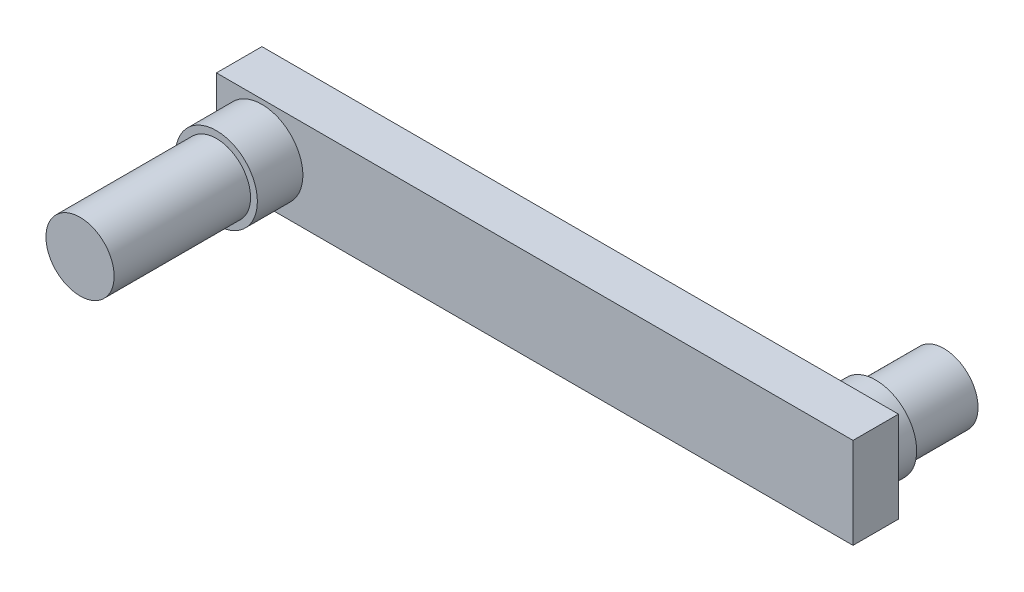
ISO-10303-21;
HEADER;
FILE_DESCRIPTION(('STEP AP214'),'2;1');
FILE_NAME('part.step','',(''),(''),'','','');
FILE_SCHEMA(('AUTOMOTIVE_DESIGN { 1 0 10303 214 1 1 1 1 }'));
ENDSEC;
DATA;
#1=APPLICATION_CONTEXT('core data for automotive mechanical design processes');
#2=APPLICATION_PROTOCOL_DEFINITION('international standard','automotive_design',2000,#1);
#3=PRODUCT_CONTEXT('',#1,'mechanical');
#4=PRODUCT('Part','Part','',(#3));
#5=PRODUCT_RELATED_PRODUCT_CATEGORY('part','',(#4));
#6=PRODUCT_DEFINITION_FORMATION('','',#4);
#7=PRODUCT_DEFINITION_CONTEXT('part definition',#1,'design');
#8=PRODUCT_DEFINITION('design','',#6,#7);
#9=PRODUCT_DEFINITION_SHAPE('','',#8);
#10=(LENGTH_UNIT() NAMED_UNIT(*) SI_UNIT(.MILLI.,.METRE.));
#11=(NAMED_UNIT(*) PLANE_ANGLE_UNIT() SI_UNIT($,.RADIAN.));
#12=(NAMED_UNIT(*) SI_UNIT($,.STERADIAN.) SOLID_ANGLE_UNIT());
#13=UNCERTAINTY_MEASURE_WITH_UNIT(LENGTH_MEASURE(1.E-05),#10,'distance_accuracy_value','');
#14=(GEOMETRIC_REPRESENTATION_CONTEXT(3) GLOBAL_UNCERTAINTY_ASSIGNED_CONTEXT((#13)) GLOBAL_UNIT_ASSIGNED_CONTEXT((#10,
#11,#12)) REPRESENTATION_CONTEXT('',''));
#15=CARTESIAN_POINT('',(0.,0.,0.));
#16=DIRECTION('',(0.,0.,1.));
#17=DIRECTION('',(1.,0.,0.));
#18=AXIS2_PLACEMENT_3D('',#15,#16,#17);
#19=CARTESIAN_POINT('',(130.,10.,-5.));
#20=DIRECTION('',(0.,0.,-1.));
#21=DIRECTION('',(-1.,0.,0.));
#22=AXIS2_PLACEMENT_3D('',#19,#20,#21);
#23=PLANE('',#22);
#24=CARTESIAN_POINT('',(130.,10.,-5.));
#25=DIRECTION('',(0.,0.,-1.));
#26=DIRECTION('',(-1.,0.,0.));
#27=AXIS2_PLACEMENT_3D('',#24,#25,#26);
#28=CIRCLE('',#27,9.);
#29=CARTESIAN_POINT('',(121.,10.,-5.));
#30=VERTEX_POINT('',#29);
#31=EDGE_CURVE('E121',#30,#30,#28,.T.);
#32=ORIENTED_EDGE('',*,*,#31,.T.);
#33=EDGE_LOOP('',(#32));
#34=FACE_BOUND('',#33,.T.);
#35=CARTESIAN_POINT('',(130.,10.,-5.));
#36=DIRECTION('',(0.,0.,-1.));
#37=DIRECTION('',(-1.,0.,0.));
#38=AXIS2_PLACEMENT_3D('',#35,#36,#37);
#39=CIRCLE('',#38,7.50000000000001);
#40=CARTESIAN_POINT('',(122.5,10.,-5.));
#41=VERTEX_POINT('',#40);
#42=EDGE_CURVE('E128',#41,#41,#39,.T.);
#43=ORIENTED_EDGE('',*,*,#42,.F.);
#44=EDGE_LOOP('',(#43));
#45=FACE_BOUND('',#44,.T.);
#46=ADVANCED_FACE('F33',(#34,#45),#23,.T.);
#47=CARTESIAN_POINT('',(0.,20.,0.));
#48=DIRECTION('',(0.,0.,-1.));
#49=DIRECTION('',(-1.,0.,0.));
#50=AXIS2_PLACEMENT_3D('',#47,#48,#49);
#51=PLANE('',#50);
#52=DIRECTION('',(0.,-1.,0.));
#53=VECTOR('',#52,1.);
#54=CARTESIAN_POINT('',(0.,0.,0.));
#55=LINE('',#54,#53);
#56=CARTESIAN_POINT('',(0.,20.,0.));
#57=VERTEX_POINT('',#56);
#58=CARTESIAN_POINT('',(0.,0.,0.));
#59=VERTEX_POINT('',#58);
#60=EDGE_CURVE('E101',#57,#59,#55,.T.);
#61=ORIENTED_EDGE('',*,*,#60,.F.);
#62=DIRECTION('',(-1.,0.,0.));
#63=VECTOR('',#62,1.);
#64=CARTESIAN_POINT('',(0.,20.,0.));
#65=LINE('',#64,#63);
#66=CARTESIAN_POINT('',(140.,20.,0.));
#67=VERTEX_POINT('',#66);
#68=EDGE_CURVE('E73',#67,#57,#65,.T.);
#69=ORIENTED_EDGE('',*,*,#68,.F.);
#70=DIRECTION('',(0.,1.,0.));
#71=VECTOR('',#70,1.);
#72=CARTESIAN_POINT('',(140.,0.,0.));
#73=LINE('',#72,#71);
#74=CARTESIAN_POINT('',(140.,0.,0.));
#75=VERTEX_POINT('',#74);
#76=EDGE_CURVE('E67',#75,#67,#73,.T.);
#77=ORIENTED_EDGE('',*,*,#76,.F.);
#78=DIRECTION('',(1.,0.,0.));
#79=VECTOR('',#78,1.);
#80=CARTESIAN_POINT('',(0.,0.,0.));
#81=LINE('',#80,#79);
#82=EDGE_CURVE('E92',#59,#75,#81,.T.);
#83=ORIENTED_EDGE('',*,*,#82,.F.);
#84=EDGE_LOOP('',(#61,#69,#77,#83));
#85=FACE_BOUND('',#84,.T.);
#86=CARTESIAN_POINT('',(130.,10.,0.));
#87=DIRECTION('',(0.,0.,-1.));
#88=DIRECTION('',(-1.,0.,0.));
#89=AXIS2_PLACEMENT_3D('',#86,#87,#88);
#90=CIRCLE('',#89,9.);
#91=CARTESIAN_POINT('',(121.,10.,0.));
#92=VERTEX_POINT('',#91);
#93=EDGE_CURVE('E119',#92,#92,#90,.T.);
#94=ORIENTED_EDGE('',*,*,#93,.F.);
#95=EDGE_LOOP('',(#94));
#96=FACE_BOUND('',#95,.T.);
#97=ADVANCED_FACE('F112',(#85,#96),#51,.T.);
#98=CARTESIAN_POINT('',(10.,10.,20.));
#99=DIRECTION('',(0.,0.,1.));
#100=DIRECTION('',(1.,0.,0.));
#101=AXIS2_PLACEMENT_3D('',#98,#99,#100);
#102=PLANE('',#101);
#103=CARTESIAN_POINT('',(10.,10.,20.));
#104=DIRECTION('',(0.,0.,1.));
#105=DIRECTION('',(1.,0.,0.));
#106=AXIS2_PLACEMENT_3D('',#103,#104,#105);
#107=CIRCLE('',#106,9.00000000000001);
#108=CARTESIAN_POINT('',(19.,10.,20.));
#109=VERTEX_POINT('',#108);
#110=EDGE_CURVE('E104',#109,#109,#107,.T.);
#111=ORIENTED_EDGE('',*,*,#110,.T.);
#112=EDGE_LOOP('',(#111));
#113=FACE_BOUND('',#112,.T.);
#114=CARTESIAN_POINT('',(10.,10.,20.));
#115=DIRECTION('',(0.,0.,1.));
#116=DIRECTION('',(1.,0.,0.));
#117=AXIS2_PLACEMENT_3D('',#114,#115,#116);
#118=CIRCLE('',#117,7.5);
#119=CARTESIAN_POINT('',(17.5,10.,20.));
#120=VERTEX_POINT('',#119);
#121=EDGE_CURVE('E125',#120,#120,#118,.T.);
#122=ORIENTED_EDGE('',*,*,#121,.F.);
#123=EDGE_LOOP('',(#122));
#124=FACE_BOUND('',#123,.T.);
#125=ADVANCED_FACE('F115',(#113,#124),#102,.T.);
#126=CARTESIAN_POINT('',(0.,20.,10.));
#127=DIRECTION('',(0.,0.,-1.));
#128=DIRECTION('',(-1.,0.,0.));
#129=AXIS2_PLACEMENT_3D('',#126,#127,#128);
#130=PLANE('',#129);
#131=DIRECTION('',(0.,-1.,0.));
#132=VECTOR('',#131,1.);
#133=CARTESIAN_POINT('',(0.,0.,10.));
#134=LINE('',#133,#132);
#135=CARTESIAN_POINT('',(0.,20.,10.));
#136=VERTEX_POINT('',#135);
#137=CARTESIAN_POINT('',(0.,0.,10.));
#138=VERTEX_POINT('',#137);
#139=EDGE_CURVE('E87',#136,#138,#134,.T.);
#140=ORIENTED_EDGE('',*,*,#139,.T.);
#141=DIRECTION('',(1.,0.,0.));
#142=VECTOR('',#141,1.);
#143=CARTESIAN_POINT('',(0.,0.,10.));
#144=LINE('',#143,#142);
#145=CARTESIAN_POINT('',(140.,0.,10.));
#146=VERTEX_POINT('',#145);
#147=EDGE_CURVE('E81',#138,#146,#144,.T.);
#148=ORIENTED_EDGE('',*,*,#147,.T.);
#149=DIRECTION('',(0.,1.,0.));
#150=VECTOR('',#149,1.);
#151=CARTESIAN_POINT('',(140.,0.,10.));
#152=LINE('',#151,#150);
#153=CARTESIAN_POINT('',(140.,20.,10.));
#154=VERTEX_POINT('',#153);
#155=EDGE_CURVE('E85',#146,#154,#152,.T.);
#156=ORIENTED_EDGE('',*,*,#155,.T.);
#157=DIRECTION('',(-1.,0.,0.));
#158=VECTOR('',#157,1.);
#159=CARTESIAN_POINT('',(0.,20.,10.));
#160=LINE('',#159,#158);
#161=EDGE_CURVE('E50',#154,#136,#160,.T.);
#162=ORIENTED_EDGE('',*,*,#161,.T.);
#163=EDGE_LOOP('',(#140,#148,#156,#162));
#164=FACE_BOUND('',#163,.T.);
#165=CARTESIAN_POINT('',(10.,10.,10.));
#166=DIRECTION('',(0.,0.,-1.));
#167=DIRECTION('',(-1.,0.,0.));
#168=AXIS2_PLACEMENT_3D('',#165,#166,#167);
#169=CIRCLE('',#168,9.00000000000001);
#170=CARTESIAN_POINT('',(0.999999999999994,10.,10.));
#171=VERTEX_POINT('',#170);
#172=EDGE_CURVE('E11',#171,#171,#169,.F.);
#173=ORIENTED_EDGE('',*,*,#172,.F.);
#174=EDGE_LOOP('',(#173));
#175=FACE_BOUND('',#174,.T.);
#176=ADVANCED_FACE('F82',(#164,#175),#130,.F.);
#177=CARTESIAN_POINT('',(0.,0.,10.));
#178=DIRECTION('',(1.,0.,0.));
#179=DIRECTION('',(0.,0.,-1.));
#180=AXIS2_PLACEMENT_3D('',#177,#178,#179);
#181=PLANE('',#180);
#182=ORIENTED_EDGE('',*,*,#60,.T.);
#183=DIRECTION('',(0.,0.,-1.));
#184=VECTOR('',#183,1.);
#185=CARTESIAN_POINT('',(0.,0.,10.));
#186=LINE('',#185,#184);
#187=EDGE_CURVE('E42',#138,#59,#186,.T.);
#188=ORIENTED_EDGE('',*,*,#187,.F.);
#189=ORIENTED_EDGE('',*,*,#139,.F.);
#190=DIRECTION('',(0.,0.,-1.));
#191=VECTOR('',#190,1.);
#192=CARTESIAN_POINT('',(0.,20.,10.));
#193=LINE('',#192,#191);
#194=EDGE_CURVE('E97',#136,#57,#193,.T.);
#195=ORIENTED_EDGE('',*,*,#194,.T.);
#196=EDGE_LOOP('',(#182,#188,#189,#195));
#197=FACE_BOUND('',#196,.T.);
#198=ADVANCED_FACE('F35',(#197),#181,.F.);
#199=CARTESIAN_POINT('',(0.,0.,10.));
#200=DIRECTION('',(0.,1.,0.));
#201=DIRECTION('',(0.,0.,1.));
#202=AXIS2_PLACEMENT_3D('',#199,#200,#201);
#203=PLANE('',#202);
#204=ORIENTED_EDGE('',*,*,#82,.T.);
#205=DIRECTION('',(0.,0.,-1.));
#206=VECTOR('',#205,1.);
#207=CARTESIAN_POINT('',(140.,0.,10.));
#208=LINE('',#207,#206);
#209=EDGE_CURVE('E90',#146,#75,#208,.T.);
#210=ORIENTED_EDGE('',*,*,#209,.F.);
#211=ORIENTED_EDGE('',*,*,#147,.F.);
#212=ORIENTED_EDGE('',*,*,#187,.T.);
#213=EDGE_LOOP('',(#204,#210,#211,#212));
#214=FACE_BOUND('',#213,.T.);
#215=ADVANCED_FACE('F91',(#214),#203,.F.);
#216=CARTESIAN_POINT('',(140.,0.,10.));
#217=DIRECTION('',(-1.,0.,0.));
#218=DIRECTION('',(0.,0.,1.));
#219=AXIS2_PLACEMENT_3D('',#216,#217,#218);
#220=PLANE('',#219);
#221=ORIENTED_EDGE('',*,*,#76,.T.);
#222=DIRECTION('',(0.,0.,-1.));
#223=VECTOR('',#222,1.);
#224=CARTESIAN_POINT('',(140.,20.,10.));
#225=LINE('',#224,#223);
#226=EDGE_CURVE('E93',#154,#67,#225,.T.);
#227=ORIENTED_EDGE('',*,*,#226,.F.);
#228=ORIENTED_EDGE('',*,*,#155,.F.);
#229=ORIENTED_EDGE('',*,*,#209,.T.);
#230=EDGE_LOOP('',(#221,#227,#228,#229));
#231=FACE_BOUND('',#230,.T.);
#232=ADVANCED_FACE('F95',(#231),#220,.F.);
#233=CARTESIAN_POINT('',(0.,20.,10.));
#234=DIRECTION('',(0.,-1.,0.));
#235=DIRECTION('',(0.,0.,-1.));
#236=AXIS2_PLACEMENT_3D('',#233,#234,#235);
#237=PLANE('',#236);
#238=ORIENTED_EDGE('',*,*,#68,.T.);
#239=ORIENTED_EDGE('',*,*,#194,.F.);
#240=ORIENTED_EDGE('',*,*,#161,.F.);
#241=ORIENTED_EDGE('',*,*,#226,.T.);
#242=EDGE_LOOP('',(#238,#239,#240,#241));
#243=FACE_BOUND('',#242,.T.);
#244=ADVANCED_FACE('F146',(#243),#237,.F.);
#245=CARTESIAN_POINT('',(10.,10.,20.));
#246=DIRECTION('',(0.,0.,-1.));
#247=DIRECTION('',(-1.,0.,0.));
#248=AXIS2_PLACEMENT_3D('',#245,#246,#247);
#249=CYLINDRICAL_SURFACE('',#248,9.00000000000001);
#250=ORIENTED_EDGE('',*,*,#110,.F.);
#251=EDGE_LOOP('',(#250));
#252=FACE_BOUND('',#251,.T.);
#253=ORIENTED_EDGE('',*,*,#172,.T.);
#254=EDGE_LOOP('',(#253));
#255=FACE_BOUND('',#254,.T.);
#256=ADVANCED_FACE('F142',(#252,#255),#249,.T.);
#257=CARTESIAN_POINT('',(10.,10.,50.));
#258=DIRECTION('',(0.,0.,-1.));
#259=DIRECTION('',(-1.,0.,0.));
#260=AXIS2_PLACEMENT_3D('',#257,#258,#259);
#261=CYLINDRICAL_SURFACE('',#260,7.5);
#262=CARTESIAN_POINT('',(10.,10.,50.));
#263=DIRECTION('',(0.,0.,1.));
#264=DIRECTION('',(1.,0.,0.));
#265=AXIS2_PLACEMENT_3D('',#262,#263,#264);
#266=CIRCLE('',#265,7.5);
#267=CARTESIAN_POINT('',(17.5,10.,50.));
#268=VERTEX_POINT('',#267);
#269=EDGE_CURVE('E132',#268,#268,#266,.T.);
#270=ORIENTED_EDGE('',*,*,#269,.F.);
#271=EDGE_LOOP('',(#270));
#272=FACE_BOUND('',#271,.T.);
#273=ORIENTED_EDGE('',*,*,#121,.T.);
#274=EDGE_LOOP('',(#273));
#275=FACE_BOUND('',#274,.T.);
#276=ADVANCED_FACE('F145',(#272,#275),#261,.T.);
#277=CARTESIAN_POINT('',(10.,10.,50.));
#278=DIRECTION('',(0.,0.,1.));
#279=DIRECTION('',(1.,0.,0.));
#280=AXIS2_PLACEMENT_3D('',#277,#278,#279);
#281=PLANE('',#280);
#282=ORIENTED_EDGE('',*,*,#269,.T.);
#283=EDGE_LOOP('',(#282));
#284=FACE_BOUND('',#283,.T.);
#285=ADVANCED_FACE('F169',(#284),#281,.T.);
#286=CARTESIAN_POINT('',(130.,10.,-5.));
#287=DIRECTION('',(0.,0.,1.));
#288=DIRECTION('',(1.,0.,0.));
#289=AXIS2_PLACEMENT_3D('',#286,#287,#288);
#290=CYLINDRICAL_SURFACE('',#289,9.);
#291=ORIENTED_EDGE('',*,*,#31,.F.);
#292=EDGE_LOOP('',(#291));
#293=FACE_BOUND('',#292,.T.);
#294=ORIENTED_EDGE('',*,*,#93,.T.);
#295=EDGE_LOOP('',(#294));
#296=FACE_BOUND('',#295,.T.);
#297=ADVANCED_FACE('F166',(#293,#296),#290,.T.);
#298=CARTESIAN_POINT('',(130.,10.,-20.));
#299=DIRECTION('',(0.,0.,1.));
#300=DIRECTION('',(1.,0.,0.));
#301=AXIS2_PLACEMENT_3D('',#298,#299,#300);
#302=CYLINDRICAL_SURFACE('',#301,7.50000000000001);
#303=CARTESIAN_POINT('',(130.,10.,-20.));
#304=DIRECTION('',(0.,0.,-1.));
#305=DIRECTION('',(-1.,0.,0.));
#306=AXIS2_PLACEMENT_3D('',#303,#304,#305);
#307=CIRCLE('',#306,7.50000000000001);
#308=CARTESIAN_POINT('',(122.5,10.,-20.));
#309=VERTEX_POINT('',#308);
#310=EDGE_CURVE('E122',#309,#309,#307,.T.);
#311=ORIENTED_EDGE('',*,*,#310,.F.);
#312=EDGE_LOOP('',(#311));
#313=FACE_BOUND('',#312,.T.);
#314=ORIENTED_EDGE('',*,*,#42,.T.);
#315=EDGE_LOOP('',(#314));
#316=FACE_BOUND('',#315,.T.);
#317=ADVANCED_FACE('F164',(#313,#316),#302,.T.);
#318=CARTESIAN_POINT('',(130.,10.,-20.));
#319=DIRECTION('',(0.,0.,-1.));
#320=DIRECTION('',(-1.,0.,0.));
#321=AXIS2_PLACEMENT_3D('',#318,#319,#320);
#322=PLANE('',#321);
#323=ORIENTED_EDGE('',*,*,#310,.T.);
#324=EDGE_LOOP('',(#323));
#325=FACE_BOUND('',#324,.T.);
#326=ADVANCED_FACE('F200',(#325),#322,.T.);
#327=CLOSED_SHELL('',(#46,#97,#125,#176,#198,#215,#232,#244,#256,#276,#285,#297,#317,#326));
#328=MANIFOLD_SOLID_BREP('B2',#327);
#329=ADVANCED_BREP_SHAPE_REPRESENTATION('',(#18,#328),#14);
#330=SHAPE_DEFINITION_REPRESENTATION(#9,#329);
ENDSEC;
END-ISO-10303-21;
